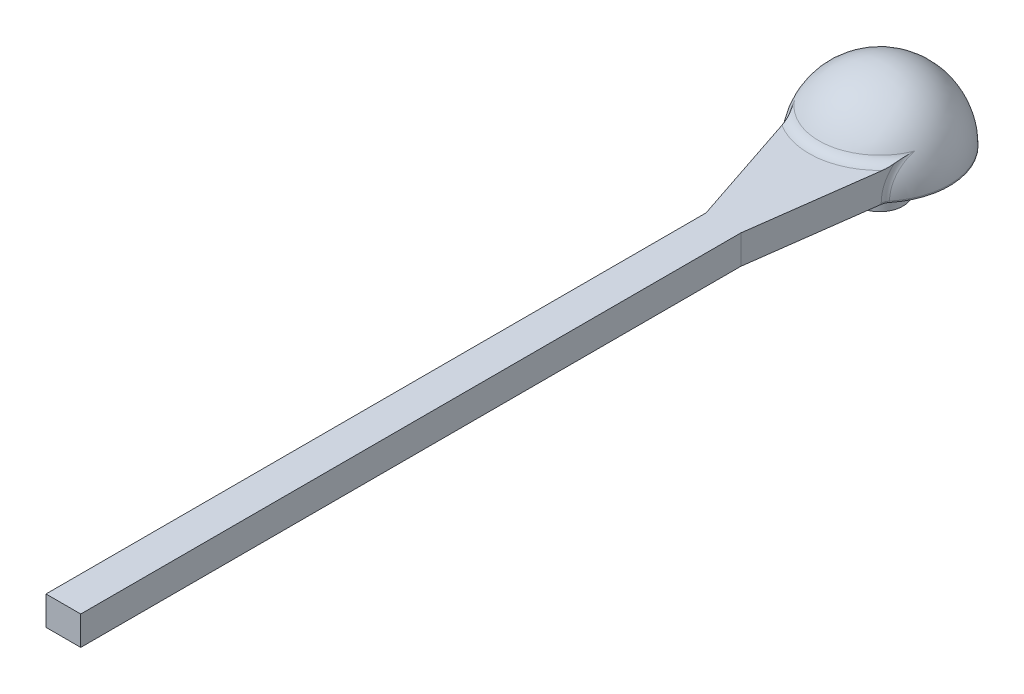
from build123d import *

# Parameters (mm, degrees)
SKETCH3_R           = 2
BOSS_EXTRUDE1_DEPTH = 3.5
SKETCH4_R           = 6
BOSS_EXTRUDE2_DEPTH = 0.1
DOME1_FACE_RADIUS   = 6
DOME1_HEIGHT        = 6
BOSS_EXTRUDE4_DEPTH = 2.5
FILLET2_R           = 1
SKETCH9_W           = 1.414213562
SKETCH9_H           = 1.414213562
CUT_EXTRUDE1_DEPTH  = 3.5


with BuildPart() as part:
    # Sketch3 → Boss-Extrude1 (new body)
    with BuildSketch(Plane(origin=(0, 0, 0), x_dir=(1, 0, 0), z_dir=(0, 1, 0))):
        with Locations(Location((0, 0, 0), (0, 0, 270))):
            Circle(SKETCH3_R)
    extrude(amount=BOSS_EXTRUDE1_DEPTH)

    # Sketch4 → Boss-Extrude2 (add)
    with BuildSketch(Plane(origin=(0, 3.5, 0), x_dir=(1, 0, 0), z_dir=(0, 1, 0))):
        with Locations(Location((0, 0, 0), (0, 0, 270))):
            Circle(SKETCH4_R)
    extrude(amount=BOSS_EXTRUDE2_DEPTH)

    # Dome1: a dome of height H over a round flat face of radius A is a cap of a sphere of radius (A * A + H * H) / (2 * H)
    dome1_r = (DOME1_FACE_RADIUS * DOME1_FACE_RADIUS + DOME1_HEIGHT * DOME1_HEIGHT) / (2 * DOME1_HEIGHT)
    dome1_base = Plane((0, 3.6, 0), z_dir=(0, 1, 0))
    with Locations(dome1_base.offset(DOME1_HEIGHT - dome1_r)):
        dome1_ball = Sphere(dome1_r, mode=Mode.PRIVATE)
    add(split(dome1_ball, bisect_by=dome1_base, keep=Keep.TOP, mode=Mode.PRIVATE))

    # Sketch5 → Boss-Extrude4 (add)
    with BuildSketch(Plane.XZ.offset(-3.5)):
        Polygon((0, 0), (-5, 0), (0, 15), (0, 72), (3, 72), (3, 15), (5, 0), align=None)
    extrude(amount=-BOSS_EXTRUDE4_DEPTH)

    # Fillet2
    fillet2_edges = [part.edges().sort_by_distance(p)[0] for p in [
        (2.612555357, 6, 4.838858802),
        (-3.410917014, 4.880227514, 4.767248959),
        (4.500044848, 4.899853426, 3.749663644),
        (4.465710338, 3.55, 4.007172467),
        (-3.338104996, 3.55, 4.985685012),
    ]]
    fillet(fillet2_edges, radius=FILLET2_R)

    # Sketch9 → Cut-Extrude1 (cut)
    with BuildSketch(Plane.XZ):
        Rectangle(SKETCH9_W, SKETCH9_H)
    extrude(amount=-CUT_EXTRUDE1_DEPTH, mode=Mode.SUBTRACT)


solid = part.part
